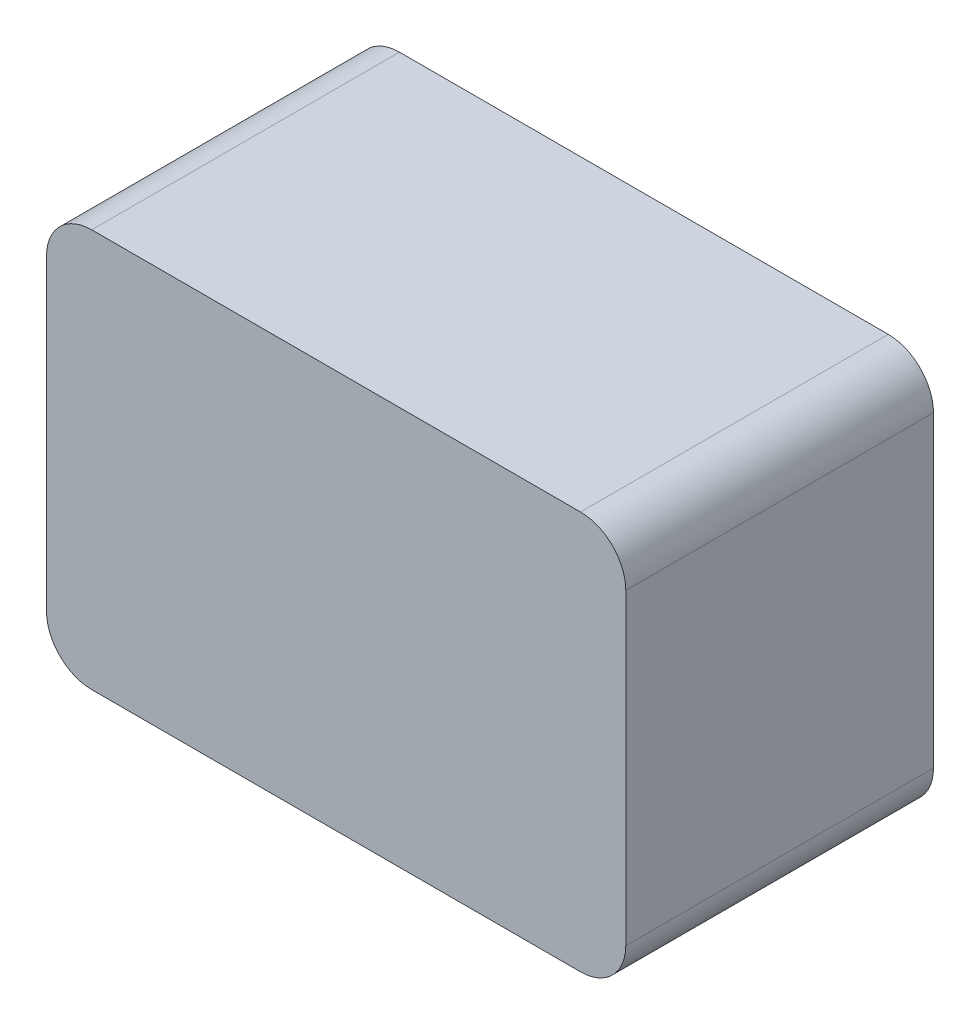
from build123d import *

# Parameters (mm, degrees)
EXTRUDE_1_DEPTH = 32
EXTRUDE_2_DEPTH = 2


with BuildPart() as part:
    # Sketch 1 → Extrude 1 (new body)
    with BuildSketch(Plane.XY):
        with BuildLine():
            Line((-23.814365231, -23.267904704), (30.185634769, -23.267904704))
            ThreePointArc((30.185634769, -23.267904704), (33.721168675, -21.80343861), (35.185634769, -18.267904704))
            Line((35.185634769, -18.267904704), (35.185634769, 15.732095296))
            ThreePointArc((35.185634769, 15.732095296), (33.721168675, 19.267629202), (30.185634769, 20.732095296))
            Line((30.185634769, 20.732095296), (-23.814365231, 20.732095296))
            ThreePointArc((-23.814365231, 20.732095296), (-27.349899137, 19.267629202), (-28.814365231, 15.732095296))
            Line((-28.814365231, 15.732095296), (-28.814365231, -18.267904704))
            ThreePointArc((-28.814365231, -18.267904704), (-27.349899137, -21.80343861), (-23.814365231, -23.267904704))
        make_face()
        with BuildLine():
            Line((-24.064365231, 10.732095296), (-24.064365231, -13.267904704))
            ThreePointArc((-24.064365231, -13.267904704), (-22.526675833, -16.980215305), (-18.814365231, -18.517904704))
            Line((-18.814365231, -18.517904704), (25.185634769, -18.517904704))
            ThreePointArc((25.185634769, -18.517904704), (28.89794537, -16.980215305), (30.435634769, -13.267904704))
            Line((30.435634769, -13.267904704), (30.435634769, 10.732095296))
            ThreePointArc((30.435634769, 10.732095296), (28.89794537, 14.444405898), (25.185634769, 15.982095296))
            Line((25.185634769, 15.982095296), (-18.814365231, 15.982095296))
            ThreePointArc((-18.814365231, 15.982095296), (-22.526675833, 14.444405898), (-24.064365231, 10.732095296))
        make_face(mode=Mode.SUBTRACT)
    extrude(amount=EXTRUDE_1_DEPTH)

    # Sketch 7 → Extrude 2 (add)
    with BuildSketch(Plane.XY.offset(32)):
        with BuildLine():
            Line((-23.814365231, -23.267904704), (30.185634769, -23.267904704))
            ThreePointArc((30.185634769, -23.267904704), (33.721168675, -21.80343861), (35.185634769, -18.267904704))
            Line((35.185634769, -18.267904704), (35.185634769, 15.732095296))
            ThreePointArc((35.185634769, 15.732095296), (33.721168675, 19.267629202), (30.185634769, 20.732095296))
            Line((30.185634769, 20.732095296), (-23.814365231, 20.732095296))
            ThreePointArc((-23.814365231, 20.732095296), (-27.349899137, 19.267629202), (-28.814365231, 15.732095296))
            Line((-28.814365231, 15.732095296), (-28.814365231, -18.267904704))
            ThreePointArc((-28.814365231, -18.267904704), (-27.349899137, -21.80343861), (-23.814365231, -23.267904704))
        make_face()
    extrude(amount=EXTRUDE_2_DEPTH)


solid = part.part
